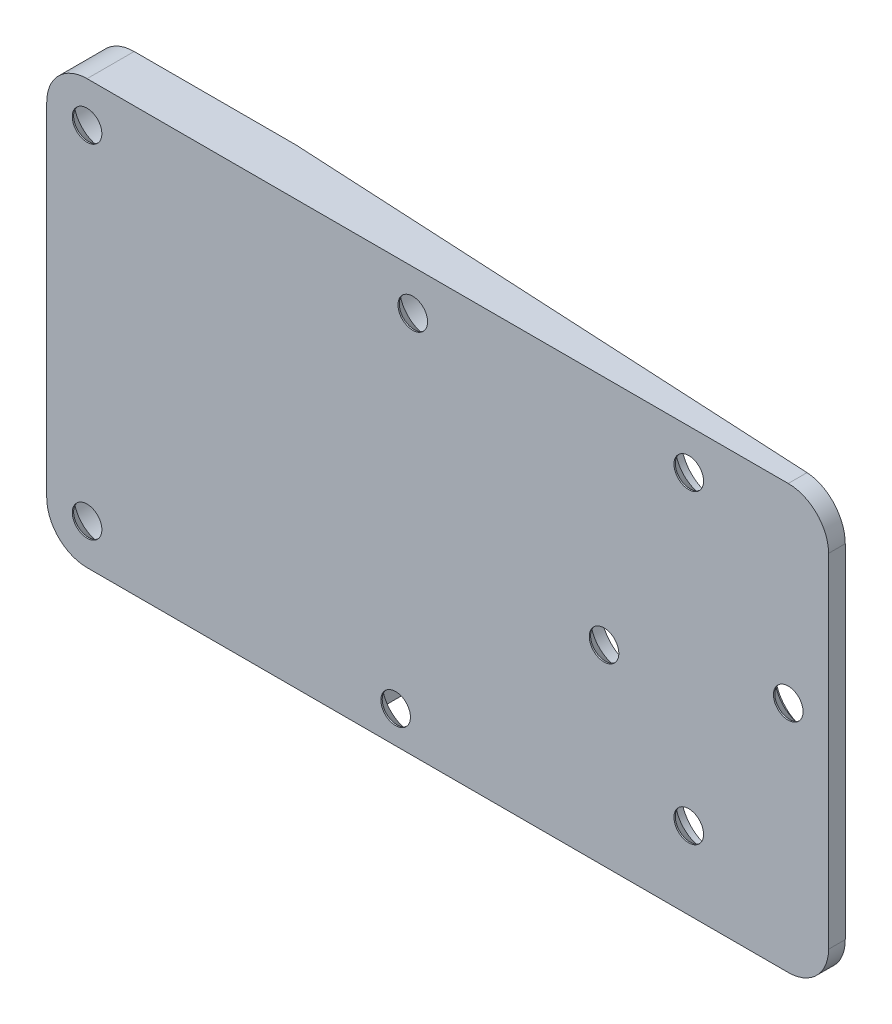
ISO-10303-21;
HEADER;
FILE_DESCRIPTION(('STEP AP214'),'2;1');
FILE_NAME('part.step','',(''),(''),'','','');
FILE_SCHEMA(('AUTOMOTIVE_DESIGN { 1 0 10303 214 1 1 1 1 }'));
ENDSEC;
DATA;
#1=APPLICATION_CONTEXT('core data for automotive mechanical design processes');
#2=APPLICATION_PROTOCOL_DEFINITION('international standard','automotive_design',2000,#1);
#3=PRODUCT_CONTEXT('',#1,'mechanical');
#4=PRODUCT('Part','Part','',(#3));
#5=PRODUCT_RELATED_PRODUCT_CATEGORY('part','',(#4));
#6=PRODUCT_DEFINITION_FORMATION('','',#4);
#7=PRODUCT_DEFINITION_CONTEXT('part definition',#1,'design');
#8=PRODUCT_DEFINITION('design','',#6,#7);
#9=PRODUCT_DEFINITION_SHAPE('','',#8);
#10=(LENGTH_UNIT() NAMED_UNIT(*) SI_UNIT(.MILLI.,.METRE.));
#11=(NAMED_UNIT(*) PLANE_ANGLE_UNIT() SI_UNIT($,.RADIAN.));
#12=(NAMED_UNIT(*) SI_UNIT($,.STERADIAN.) SOLID_ANGLE_UNIT());
#13=UNCERTAINTY_MEASURE_WITH_UNIT(LENGTH_MEASURE(1.E-05),#10,'distance_accuracy_value','');
#14=(GEOMETRIC_REPRESENTATION_CONTEXT(3) GLOBAL_UNCERTAINTY_ASSIGNED_CONTEXT((#13)) GLOBAL_UNIT_ASSIGNED_CONTEXT((#10,
#11,#12)) REPRESENTATION_CONTEXT('',''));
#15=CARTESIAN_POINT('',(0.,0.,0.));
#16=DIRECTION('',(0.,0.,1.));
#17=DIRECTION('',(1.,0.,0.));
#18=AXIS2_PLACEMENT_3D('',#15,#16,#17);
#19=CARTESIAN_POINT('',(19.5809830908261,-59.7,-6.));
#20=DIRECTION('',(0.0523359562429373,0.,-0.998629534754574));
#21=DIRECTION('',(-0.998629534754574,0.,-0.0523359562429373));
#22=AXIS2_PLACEMENT_3D('',#19,#20,#21);
#23=PLANE('',#22);
#24=CARTESIAN_POINT('',(31.7740209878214,-64.25,-5.36098996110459));
#25=DIRECTION('',(0.0523359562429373,0.,-0.998629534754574));
#26=DIRECTION('',(-0.998629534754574,0.,-0.0523359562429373));
#27=AXIS2_PLACEMENT_3D('',#24,#25,#26);
#28=ELLIPSE('',#27,2.5034308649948,2.5);
#29=CARTESIAN_POINT('',(29.2740209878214,-64.25,-5.49200940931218));
#30=VERTEX_POINT('',#29);
#31=EDGE_CURVE('E227',#30,#30,#28,.T.);
#32=ORIENTED_EDGE('',*,*,#31,.F.);
#33=EDGE_LOOP('',(#32));
#34=FACE_BOUND('',#33,.T.);
#35=CARTESIAN_POINT('',(52.3,-64.25,-4.28526898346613));
#36=DIRECTION('',(0.0523359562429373,0.,-0.998629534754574));
#37=DIRECTION('',(-0.998629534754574,0.,-0.0523359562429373));
#38=AXIS2_PLACEMENT_3D('',#35,#36,#37);
#39=ELLIPSE('',#38,2.5034308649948,2.5);
#40=CARTESIAN_POINT('',(49.8,-64.25,-4.41628843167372));
#41=VERTEX_POINT('',#40);
#42=EDGE_CURVE('E244',#41,#41,#39,.T.);
#43=ORIENTED_EDGE('',*,*,#42,.F.);
#44=EDGE_LOOP('',(#43));
#45=FACE_BOUND('',#44,.T.);
#46=CARTESIAN_POINT('',(46.,-78.5,-4.61543799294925));
#47=DIRECTION('',(0.0523359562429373,0.,-0.998629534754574));
#48=DIRECTION('',(-0.998629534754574,0.,-0.0523359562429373));
#49=AXIS2_PLACEMENT_3D('',#46,#47,#48);
#50=ELLIPSE('',#49,2.5034308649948,2.5);
#51=CARTESIAN_POINT('',(43.5,-78.5,-4.74645744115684));
#52=VERTEX_POINT('',#51);
#53=EDGE_CURVE('E261',#52,#52,#50,.T.);
#54=ORIENTED_EDGE('',*,*,#53,.F.);
#55=EDGE_LOOP('',(#54));
#56=FACE_BOUND('',#55,.T.);
#57=CARTESIAN_POINT('',(52.3,-87.,-4.28526898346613));
#58=DIRECTION('',(0.0523359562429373,0.,-0.998629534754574));
#59=DIRECTION('',(-0.998629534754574,0.,-0.0523359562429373));
#60=AXIS2_PLACEMENT_3D('',#57,#58,#59);
#61=ELLIPSE('',#60,2.5034308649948,2.5);
#62=CARTESIAN_POINT('',(49.8,-87.,-4.41628843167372));
#63=VERTEX_POINT('',#62);
#64=EDGE_CURVE('E278',#63,#63,#61,.T.);
#65=ORIENTED_EDGE('',*,*,#64,.F.);
#66=EDGE_LOOP('',(#65));
#67=FACE_BOUND('',#66,.T.);
#68=CARTESIAN_POINT('',(59.7,-75.4,-3.89745141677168));
#69=DIRECTION('',(0.0523359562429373,0.,-0.998629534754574));
#70=DIRECTION('',(-0.998629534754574,0.,-0.0523359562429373));
#71=AXIS2_PLACEMENT_3D('',#68,#69,#70);
#72=ELLIPSE('',#71,2.5034308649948,2.5);
#73=CARTESIAN_POINT('',(57.2,-75.4,-4.02847086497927));
#74=VERTEX_POINT('',#73);
#75=EDGE_CURVE('E295',#74,#74,#72,.T.);
#76=ORIENTED_EDGE('',*,*,#75,.F.);
#77=EDGE_LOOP('',(#76));
#78=FACE_BOUND('',#77,.T.);
#79=DIRECTION('',(0.,-1.,0.));
#80=VECTOR('',#79,1.);
#81=CARTESIAN_POINT('',(28.,-59.7,-5.55877802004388));
#82=LINE('',#81,#80);
#83=CARTESIAN_POINT('',(28.,-90.35,-5.55877802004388));
#84=VERTEX_POINT('',#83);
#85=CARTESIAN_POINT('',(28.,-92.25,-5.55877802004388));
#86=VERTEX_POINT('',#85);
#87=EDGE_CURVE('E441',#84,#86,#82,.T.);
#88=ORIENTED_EDGE('',*,*,#87,.T.);
#89=DIRECTION('',(0.706621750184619,0.706621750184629,0.0370324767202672));
#90=VECTOR('',#89,1.);
#91=CARTESIAN_POINT('',(40.0373990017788,-80.212600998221,-4.92792467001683));
#92=LINE('',#91,#90);
#93=CARTESIAN_POINT('',(27.5,-92.75,-5.58498190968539));
#94=VERTEX_POINT('',#93);
#95=EDGE_CURVE('E428',#86,#94,#92,.F.);
#96=ORIENTED_EDGE('',*,*,#95,.T.);
#97=DIRECTION('',(0.998629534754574,0.,0.0523359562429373));
#98=VECTOR('',#97,1.);
#99=CARTESIAN_POINT('',(7.54178284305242,-92.75,-6.63094774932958));
#100=LINE('',#99,#98);
#101=CARTESIAN_POINT('',(19.5809830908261,-92.75,-6.));
#102=VERTEX_POINT('',#101);
#103=EDGE_CURVE('E367',#102,#94,#100,.T.);
#104=ORIENTED_EDGE('',*,*,#103,.F.);
#105=DIRECTION('',(0.,-1.,0.));
#106=VECTOR('',#105,1.);
#107=CARTESIAN_POINT('',(19.5809830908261,-59.7,-6.));
#108=LINE('',#107,#106);
#109=CARTESIAN_POINT('',(19.5809830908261,-61.25,-6.));
#110=VERTEX_POINT('',#109);
#111=EDGE_CURVE('E329',#110,#102,#108,.T.);
#112=ORIENTED_EDGE('',*,*,#111,.F.);
#113=DIRECTION('',(-0.998629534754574,0.,-0.0523359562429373));
#114=VECTOR('',#113,1.);
#115=CARTESIAN_POINT('',(7.54178284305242,-61.25,-6.63094774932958));
#116=LINE('',#115,#114);
#117=CARTESIAN_POINT('',(59.7,-61.25,-3.89745141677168));
#118=VERTEX_POINT('',#117);
#119=EDGE_CURVE('E343',#118,#110,#116,.T.);
#120=ORIENTED_EDGE('',*,*,#119,.F.);
#121=CARTESIAN_POINT('',(59.7,-64.25,-3.89745141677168));
#122=DIRECTION('',(0.0523359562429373,0.,-0.998629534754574));
#123=DIRECTION('',(0.998629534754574,0.,0.0523359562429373));
#124=AXIS2_PLACEMENT_3D('',#121,#122,#123);
#125=ELLIPSE('',#124,3.00411703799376,3.);
#126=CARTESIAN_POINT('',(62.7,-64.25,-3.74022807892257));
#127=VERTEX_POINT('',#126);
#128=EDGE_CURVE('E352',#127,#118,#125,.F.);
#129=ORIENTED_EDGE('',*,*,#128,.F.);
#130=DIRECTION('',(0.,1.,0.));
#131=VECTOR('',#130,1.);
#132=CARTESIAN_POINT('',(62.7,-89.75,-3.74022807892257));
#133=LINE('',#132,#131);
#134=CARTESIAN_POINT('',(62.7,-89.75,-3.74022807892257));
#135=VERTEX_POINT('',#134);
#136=EDGE_CURVE('E357',#135,#127,#133,.T.);
#137=ORIENTED_EDGE('',*,*,#136,.F.);
#138=CARTESIAN_POINT('',(59.7,-89.75,-3.89745141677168));
#139=DIRECTION('',(0.0523359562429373,0.,-0.998629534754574));
#140=DIRECTION('',(0.998629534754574,0.,0.0523359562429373));
#141=AXIS2_PLACEMENT_3D('',#138,#139,#140);
#142=ELLIPSE('',#141,3.00411703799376,3.);
#143=CARTESIAN_POINT('',(59.7,-92.75,-3.89745141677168));
#144=VERTEX_POINT('',#143);
#145=EDGE_CURVE('E362',#144,#135,#142,.F.);
#146=ORIENTED_EDGE('',*,*,#145,.F.);
#147=CARTESIAN_POINT('',(33.5,-92.75,-5.27053523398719));
#148=VERTEX_POINT('',#147);
#149=EDGE_CURVE('E371',#148,#144,#100,.T.);
#150=ORIENTED_EDGE('',*,*,#149,.F.);
#151=DIRECTION('',(0.706621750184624,-0.706621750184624,0.0370324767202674));
#152=VECTOR('',#151,1.);
#153=CARTESIAN_POINT('',(10.0286097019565,-69.2786097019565,-6.50061867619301));
#154=LINE('',#153,#152);
#155=CARTESIAN_POINT('',(33.,-92.25,-5.2967391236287));
#156=VERTEX_POINT('',#155);
#157=EDGE_CURVE('E75',#148,#156,#154,.F.);
#158=ORIENTED_EDGE('',*,*,#157,.T.);
#159=DIRECTION('',(0.,1.,0.));
#160=VECTOR('',#159,1.);
#161=CARTESIAN_POINT('',(33.,-59.7,-5.2967391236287));
#162=LINE('',#161,#160);
#163=CARTESIAN_POINT('',(33.,-90.35,-5.2967391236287));
#164=VERTEX_POINT('',#163);
#165=EDGE_CURVE('E927',#156,#164,#162,.T.);
#166=ORIENTED_EDGE('',*,*,#165,.T.);
#167=CARTESIAN_POINT('',(30.5,-90.35,-5.42775857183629));
#168=DIRECTION('',(0.0523359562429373,0.,-0.998629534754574));
#169=DIRECTION('',(-0.998629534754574,0.,-0.0523359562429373));
#170=AXIS2_PLACEMENT_3D('',#167,#168,#169);
#171=ELLIPSE('',#170,2.5034308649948,2.5);
#172=EDGE_CURVE('E179',#84,#164,#171,.T.);
#173=ORIENTED_EDGE('',*,*,#172,.F.);
#174=EDGE_LOOP('',(#88,#96,#104,#112,#120,#129,#137,#146,#150,#158,#166,#173));
#175=FACE_BOUND('',#174,.T.);
#176=ADVANCED_FACE('F53',(#34,#45,#56,#67,#78,#175),#23,.T.);
#177=CARTESIAN_POINT('',(7.55000000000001,-92.75,-6.78774044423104));
#178=DIRECTION('',(0.,-1.,0.));
#179=DIRECTION('',(0.,0.,-1.));
#180=AXIS2_PLACEMENT_3D('',#177,#178,#179);
#181=PLANE('',#180);
#182=ORIENTED_EDGE('',*,*,#103,.T.);
#183=DIRECTION('',(0.,0.,1.));
#184=VECTOR('',#183,1.);
#185=CARTESIAN_POINT('',(27.5,-92.75,-6.78774044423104));
#186=LINE('',#185,#184);
#187=CARTESIAN_POINT('',(27.5,-92.75,-3.69999999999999));
#188=VERTEX_POINT('',#187);
#189=EDGE_CURVE('E419',#94,#188,#186,.T.);
#190=ORIENTED_EDGE('',*,*,#189,.T.);
#191=DIRECTION('',(-1.,0.,0.));
#192=VECTOR('',#191,1.);
#193=CARTESIAN_POINT('',(7.55000000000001,-92.75,-3.69999999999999));
#194=LINE('',#193,#192);
#195=CARTESIAN_POINT('',(33.5,-92.75,-3.69999999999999));
#196=VERTEX_POINT('',#195);
#197=EDGE_CURVE('E397',#196,#188,#194,.T.);
#198=ORIENTED_EDGE('',*,*,#197,.F.);
#199=DIRECTION('',(0.,0.,-1.));
#200=VECTOR('',#199,1.);
#201=CARTESIAN_POINT('',(33.5,-92.75,-6.78774044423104));
#202=LINE('',#201,#200);
#203=EDGE_CURVE('E181',#196,#148,#202,.T.);
#204=ORIENTED_EDGE('',*,*,#203,.T.);
#205=ORIENTED_EDGE('',*,*,#149,.T.);
#206=DIRECTION('',(0.,0.,1.));
#207=VECTOR('',#206,1.);
#208=CARTESIAN_POINT('',(59.7,-92.75,-6.78774044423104));
#209=LINE('',#208,#207);
#210=CARTESIAN_POINT('',(59.7,-92.75,-2.5));
#211=VERTEX_POINT('',#210);
#212=EDGE_CURVE('E366',#144,#211,#209,.T.);
#213=ORIENTED_EDGE('',*,*,#212,.T.);
#214=DIRECTION('',(1.,0.,0.));
#215=VECTOR('',#214,1.);
#216=CARTESIAN_POINT('',(7.55000000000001,-92.75,-2.5));
#217=LINE('',#216,#215);
#218=CARTESIAN_POINT('',(7.55000000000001,-92.75,-2.5));
#219=VERTEX_POINT('',#218);
#220=EDGE_CURVE('E313',#219,#211,#217,.T.);
#221=ORIENTED_EDGE('',*,*,#220,.F.);
#222=DIRECTION('',(0.,0.,1.));
#223=VECTOR('',#222,1.);
#224=CARTESIAN_POINT('',(7.55000000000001,-92.75,-6.78774044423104));
#225=LINE('',#224,#223);
#226=CARTESIAN_POINT('',(7.55000000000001,-92.75,-6.00000000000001));
#227=VERTEX_POINT('',#226);
#228=EDGE_CURVE('E376',#227,#219,#225,.T.);
#229=ORIENTED_EDGE('',*,*,#228,.F.);
#230=DIRECTION('',(1.,0.,0.));
#231=VECTOR('',#230,1.);
#232=CARTESIAN_POINT('',(7.55000000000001,-92.75,-6.00000000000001));
#233=LINE('',#232,#231);
#234=EDGE_CURVE('E372',#227,#102,#233,.T.);
#235=ORIENTED_EDGE('',*,*,#234,.T.);
#236=EDGE_LOOP('',(#182,#190,#198,#204,#205,#213,#221,#229,#235));
#237=FACE_BOUND('',#236,.T.);
#238=ADVANCED_FACE('F447',(#237),#181,.T.);
#239=CARTESIAN_POINT('',(30.5,-90.35,-5.99999999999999));
#240=DIRECTION('',(0.,0.,-1.));
#241=DIRECTION('',(-1.,0.,0.));
#242=AXIS2_PLACEMENT_3D('',#239,#240,#241);
#243=CYLINDRICAL_SURFACE('',#242,2.5);
#244=ORIENTED_EDGE('',*,*,#172,.T.);
#245=DIRECTION('',(0.,0.,-1.));
#246=VECTOR('',#245,1.);
#247=CARTESIAN_POINT('',(33.,-90.35,-5.99999999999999));
#248=LINE('',#247,#246);
#249=CARTESIAN_POINT('',(33.,-90.35,-3.69999999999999));
#250=VERTEX_POINT('',#249);
#251=EDGE_CURVE('E165',#164,#250,#248,.F.);
#252=ORIENTED_EDGE('',*,*,#251,.T.);
#253=CARTESIAN_POINT('',(30.5,-90.35,-3.69999999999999));
#254=DIRECTION('',(0.,0.,-1.));
#255=DIRECTION('',(-1.,0.,0.));
#256=AXIS2_PLACEMENT_3D('',#253,#254,#255);
#257=CIRCLE('',#256,2.5);
#258=CARTESIAN_POINT('',(28.,-90.35,-3.69999999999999));
#259=VERTEX_POINT('',#258);
#260=EDGE_CURVE('E177',#259,#250,#257,.T.);
#261=ORIENTED_EDGE('',*,*,#260,.F.);
#262=DIRECTION('',(0.,0.,-1.));
#263=VECTOR('',#262,1.);
#264=CARTESIAN_POINT('',(28.,-90.35,-5.99999999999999));
#265=LINE('',#264,#263);
#266=EDGE_CURVE('E182',#84,#259,#265,.F.);
#267=ORIENTED_EDGE('',*,*,#266,.F.);
#268=EDGE_LOOP('',(#244,#252,#261,#267));
#269=FACE_BOUND('',#268,.T.);
#270=ADVANCED_FACE('F175',(#269),#243,.F.);
#271=CARTESIAN_POINT('',(0.,-59.7,-6.00000000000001));
#272=DIRECTION('',(0.,0.,-1.));
#273=DIRECTION('',(-1.,0.,0.));
#274=AXIS2_PLACEMENT_3D('',#271,#272,#273);
#275=PLANE('',#274);
#276=CARTESIAN_POINT('',(7.55000000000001,-64.25,-6.00000000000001));
#277=DIRECTION('',(0.,0.,-1.));
#278=DIRECTION('',(-1.,0.,0.));
#279=AXIS2_PLACEMENT_3D('',#276,#277,#278);
#280=CIRCLE('',#279,2.5);
#281=CARTESIAN_POINT('',(5.05000000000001,-64.25,-6.00000000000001));
#282=VERTEX_POINT('',#281);
#283=EDGE_CURVE('E501',#282,#282,#280,.T.);
#284=ORIENTED_EDGE('',*,*,#283,.F.);
#285=EDGE_LOOP('',(#284));
#286=FACE_BOUND('',#285,.T.);
#287=CARTESIAN_POINT('',(7.55000000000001,-89.75,-6.00000000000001));
#288=DIRECTION('',(0.,0.,-1.));
#289=DIRECTION('',(-1.,0.,0.));
#290=AXIS2_PLACEMENT_3D('',#287,#288,#289);
#291=CIRCLE('',#290,2.5);
#292=CARTESIAN_POINT('',(5.05000000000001,-89.75,-6.00000000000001));
#293=VERTEX_POINT('',#292);
#294=EDGE_CURVE('E504',#293,#293,#291,.T.);
#295=ORIENTED_EDGE('',*,*,#294,.F.);
#296=EDGE_LOOP('',(#295));
#297=FACE_BOUND('',#296,.T.);
#298=DIRECTION('',(-1.,0.,0.));
#299=VECTOR('',#298,1.);
#300=CARTESIAN_POINT('',(7.55000000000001,-61.25,-6.00000000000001));
#301=LINE('',#300,#299);
#302=CARTESIAN_POINT('',(7.55000000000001,-61.25,-6.00000000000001));
#303=VERTEX_POINT('',#302);
#304=EDGE_CURVE('E347',#110,#303,#301,.T.);
#305=ORIENTED_EDGE('',*,*,#304,.F.);
#306=ORIENTED_EDGE('',*,*,#111,.T.);
#307=ORIENTED_EDGE('',*,*,#234,.F.);
#308=CARTESIAN_POINT('',(7.55000000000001,-89.75,-6.00000000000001));
#309=DIRECTION('',(0.,0.,-1.));
#310=DIRECTION('',(-1.,0.,0.));
#311=AXIS2_PLACEMENT_3D('',#308,#309,#310);
#312=CIRCLE('',#311,3.);
#313=CARTESIAN_POINT('',(4.55,-89.75,-6.00000000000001));
#314=VERTEX_POINT('',#313);
#315=EDGE_CURVE('E377',#314,#227,#312,.F.);
#316=ORIENTED_EDGE('',*,*,#315,.F.);
#317=DIRECTION('',(0.,-1.,0.));
#318=VECTOR('',#317,1.);
#319=CARTESIAN_POINT('',(4.55,-89.75,-6.00000000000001));
#320=LINE('',#319,#318);
#321=CARTESIAN_POINT('',(4.55,-64.25,-6.00000000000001));
#322=VERTEX_POINT('',#321);
#323=EDGE_CURVE('E300',#322,#314,#320,.T.);
#324=ORIENTED_EDGE('',*,*,#323,.F.);
#325=CARTESIAN_POINT('',(7.55000000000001,-64.25,-6.00000000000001));
#326=DIRECTION('',(0.,0.,-1.));
#327=DIRECTION('',(-1.,0.,0.));
#328=AXIS2_PLACEMENT_3D('',#325,#326,#327);
#329=CIRCLE('',#328,3.);
#330=EDGE_CURVE('E337',#303,#322,#329,.F.);
#331=ORIENTED_EDGE('',*,*,#330,.F.);
#332=EDGE_LOOP('',(#305,#306,#307,#316,#324,#331));
#333=FACE_BOUND('',#332,.T.);
#334=ADVANCED_FACE('F451',(#286,#297,#333),#275,.T.);
#335=CARTESIAN_POINT('',(7.55000000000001,-64.25,-2.5));
#336=DIRECTION('',(0.,0.,1.));
#337=DIRECTION('',(1.,0.,0.));
#338=AXIS2_PLACEMENT_3D('',#335,#336,#337);
#339=PLANE('',#338);
#340=CARTESIAN_POINT('',(7.55000000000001,-64.25,-2.5));
#341=DIRECTION('',(0.,0.,-1.));
#342=DIRECTION('',(-1.,0.,0.));
#343=AXIS2_PLACEMENT_3D('',#340,#341,#342);
#344=CIRCLE('',#343,1.1);
#345=CARTESIAN_POINT('',(6.45000000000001,-64.25,-2.5));
#346=VERTEX_POINT('',#345);
#347=EDGE_CURVE('E508',#346,#346,#344,.T.);
#348=ORIENTED_EDGE('',*,*,#347,.T.);
#349=EDGE_LOOP('',(#348));
#350=FACE_BOUND('',#349,.T.);
#351=CARTESIAN_POINT('',(7.55000000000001,-89.75,-2.5));
#352=DIRECTION('',(0.,0.,-1.));
#353=DIRECTION('',(-1.,0.,0.));
#354=AXIS2_PLACEMENT_3D('',#351,#352,#353);
#355=CIRCLE('',#354,1.1);
#356=CARTESIAN_POINT('',(6.45000000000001,-89.75,-2.5));
#357=VERTEX_POINT('',#356);
#358=EDGE_CURVE('E190',#357,#357,#355,.T.);
#359=ORIENTED_EDGE('',*,*,#358,.T.);
#360=EDGE_LOOP('',(#359));
#361=FACE_BOUND('',#360,.T.);
#362=CARTESIAN_POINT('',(30.5,-90.35,-2.49999999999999));
#363=DIRECTION('',(0.,0.,-1.));
#364=DIRECTION('',(-1.,0.,0.));
#365=AXIS2_PLACEMENT_3D('',#362,#363,#364);
#366=CIRCLE('',#365,1.1);
#367=CARTESIAN_POINT('',(29.4,-90.35,-2.49999999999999));
#368=VERTEX_POINT('',#367);
#369=EDGE_CURVE('E205',#368,#368,#366,.T.);
#370=ORIENTED_EDGE('',*,*,#369,.T.);
#371=EDGE_LOOP('',(#370));
#372=FACE_BOUND('',#371,.T.);
#373=CARTESIAN_POINT('',(31.7740209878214,-64.25,-2.49999999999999));
#374=DIRECTION('',(0.,0.,-1.));
#375=DIRECTION('',(-1.,0.,0.));
#376=AXIS2_PLACEMENT_3D('',#373,#374,#375);
#377=CIRCLE('',#376,1.1);
#378=CARTESIAN_POINT('',(30.6740209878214,-64.25,-2.49999999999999));
#379=VERTEX_POINT('',#378);
#380=EDGE_CURVE('E223',#379,#379,#377,.T.);
#381=ORIENTED_EDGE('',*,*,#380,.T.);
#382=EDGE_LOOP('',(#381));
#383=FACE_BOUND('',#382,.T.);
#384=CARTESIAN_POINT('',(52.3,-64.25,-2.49999999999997));
#385=DIRECTION('',(0.,0.,-1.));
#386=DIRECTION('',(-1.,0.,0.));
#387=AXIS2_PLACEMENT_3D('',#384,#385,#386);
#388=CIRCLE('',#387,1.1);
#389=CARTESIAN_POINT('',(51.2,-64.25,-2.49999999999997));
#390=VERTEX_POINT('',#389);
#391=EDGE_CURVE('E240',#390,#390,#388,.T.);
#392=ORIENTED_EDGE('',*,*,#391,.T.);
#393=EDGE_LOOP('',(#392));
#394=FACE_BOUND('',#393,.T.);
#395=CARTESIAN_POINT('',(46.,-78.5,-2.49999999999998));
#396=DIRECTION('',(0.,0.,-1.));
#397=DIRECTION('',(-1.,0.,0.));
#398=AXIS2_PLACEMENT_3D('',#395,#396,#397);
#399=CIRCLE('',#398,1.1);
#400=CARTESIAN_POINT('',(44.9,-78.5,-2.49999999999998));
#401=VERTEX_POINT('',#400);
#402=EDGE_CURVE('E257',#401,#401,#399,.T.);
#403=ORIENTED_EDGE('',*,*,#402,.T.);
#404=EDGE_LOOP('',(#403));
#405=FACE_BOUND('',#404,.T.);
#406=CARTESIAN_POINT('',(52.3,-87.,-2.49999999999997));
#407=DIRECTION('',(0.,0.,-1.));
#408=DIRECTION('',(-1.,0.,0.));
#409=AXIS2_PLACEMENT_3D('',#406,#407,#408);
#410=CIRCLE('',#409,1.1);
#411=CARTESIAN_POINT('',(51.2,-87.,-2.49999999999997));
#412=VERTEX_POINT('',#411);
#413=EDGE_CURVE('E274',#412,#412,#410,.T.);
#414=ORIENTED_EDGE('',*,*,#413,.T.);
#415=EDGE_LOOP('',(#414));
#416=FACE_BOUND('',#415,.T.);
#417=CARTESIAN_POINT('',(59.7,-75.4,-2.49999999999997));
#418=DIRECTION('',(0.,0.,-1.));
#419=DIRECTION('',(-1.,0.,0.));
#420=AXIS2_PLACEMENT_3D('',#417,#418,#419);
#421=CIRCLE('',#420,1.1);
#422=CARTESIAN_POINT('',(58.6,-75.4,-2.49999999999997));
#423=VERTEX_POINT('',#422);
#424=EDGE_CURVE('E291',#423,#423,#421,.T.);
#425=ORIENTED_EDGE('',*,*,#424,.T.);
#426=EDGE_LOOP('',(#425));
#427=FACE_BOUND('',#426,.T.);
#428=CARTESIAN_POINT('',(7.55000000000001,-64.25,-2.5));
#429=DIRECTION('',(0.,0.,1.));
#430=DIRECTION('',(1.,0.,0.));
#431=AXIS2_PLACEMENT_3D('',#428,#429,#430);
#432=CIRCLE('',#431,3.);
#433=CARTESIAN_POINT('',(7.55000000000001,-61.25,-2.5));
#434=VERTEX_POINT('',#433);
#435=CARTESIAN_POINT('',(4.55,-64.25,-2.5));
#436=VERTEX_POINT('',#435);
#437=EDGE_CURVE('E325',#434,#436,#432,.T.);
#438=ORIENTED_EDGE('',*,*,#437,.T.);
#439=DIRECTION('',(0.,-1.,0.));
#440=VECTOR('',#439,1.);
#441=CARTESIAN_POINT('',(4.55,-89.75,-2.5));
#442=LINE('',#441,#440);
#443=CARTESIAN_POINT('',(4.55,-89.75,-2.5));
#444=VERTEX_POINT('',#443);
#445=EDGE_CURVE('E321',#436,#444,#442,.T.);
#446=ORIENTED_EDGE('',*,*,#445,.T.);
#447=CARTESIAN_POINT('',(7.55000000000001,-89.75,-2.5));
#448=DIRECTION('',(0.,0.,1.));
#449=DIRECTION('',(1.,0.,0.));
#450=AXIS2_PLACEMENT_3D('',#447,#448,#449);
#451=CIRCLE('',#450,3.);
#452=EDGE_CURVE('E317',#444,#219,#451,.T.);
#453=ORIENTED_EDGE('',*,*,#452,.T.);
#454=ORIENTED_EDGE('',*,*,#220,.T.);
#455=CARTESIAN_POINT('',(59.7,-89.75,-2.5));
#456=DIRECTION('',(0.,0.,1.));
#457=DIRECTION('',(1.,0.,0.));
#458=AXIS2_PLACEMENT_3D('',#455,#456,#457);
#459=CIRCLE('',#458,3.);
#460=CARTESIAN_POINT('',(62.7,-89.75,-2.5));
#461=VERTEX_POINT('',#460);
#462=EDGE_CURVE('E309',#211,#461,#459,.T.);
#463=ORIENTED_EDGE('',*,*,#462,.T.);
#464=DIRECTION('',(0.,1.,0.));
#465=VECTOR('',#464,1.);
#466=CARTESIAN_POINT('',(62.7,-89.75,-2.5));
#467=LINE('',#466,#465);
#468=CARTESIAN_POINT('',(62.7,-64.25,-2.5));
#469=VERTEX_POINT('',#468);
#470=EDGE_CURVE('E305',#461,#469,#467,.T.);
#471=ORIENTED_EDGE('',*,*,#470,.T.);
#472=CARTESIAN_POINT('',(59.7,-64.25,-2.5));
#473=DIRECTION('',(0.,0.,1.));
#474=DIRECTION('',(1.,0.,0.));
#475=AXIS2_PLACEMENT_3D('',#472,#473,#474);
#476=CIRCLE('',#475,3.);
#477=CARTESIAN_POINT('',(59.7,-61.25,-2.5));
#478=VERTEX_POINT('',#477);
#479=EDGE_CURVE('E301',#469,#478,#476,.T.);
#480=ORIENTED_EDGE('',*,*,#479,.T.);
#481=DIRECTION('',(-1.,0.,0.));
#482=VECTOR('',#481,1.);
#483=CARTESIAN_POINT('',(7.55000000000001,-61.25,-2.5));
#484=LINE('',#483,#482);
#485=EDGE_CURVE('E296',#478,#434,#484,.T.);
#486=ORIENTED_EDGE('',*,*,#485,.T.);
#487=EDGE_LOOP('',(#438,#446,#453,#454,#463,#471,#480,#486));
#488=FACE_BOUND('',#487,.T.);
#489=ADVANCED_FACE('F489',(#350,#361,#372,#383,#394,#405,#416,#427,#488),#339,.T.);
#490=CARTESIAN_POINT('',(4.55,-89.75,-6.78774044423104));
#491=DIRECTION('',(-1.,0.,0.));
#492=DIRECTION('',(0.,0.,1.));
#493=AXIS2_PLACEMENT_3D('',#490,#491,#492);
#494=PLANE('',#493);
#495=DIRECTION('',(0.,0.,1.));
#496=VECTOR('',#495,1.);
#497=CARTESIAN_POINT('',(4.55,-64.25,-6.78774044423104));
#498=LINE('',#497,#496);
#499=EDGE_CURVE('E341',#322,#436,#498,.T.);
#500=ORIENTED_EDGE('',*,*,#499,.F.);
#501=ORIENTED_EDGE('',*,*,#323,.T.);
#502=DIRECTION('',(0.,0.,1.));
#503=VECTOR('',#502,1.);
#504=CARTESIAN_POINT('',(4.55,-89.75,-6.78774044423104));
#505=LINE('',#504,#503);
#506=EDGE_CURVE('E336',#314,#444,#505,.T.);
#507=ORIENTED_EDGE('',*,*,#506,.T.);
#508=ORIENTED_EDGE('',*,*,#445,.F.);
#509=EDGE_LOOP('',(#500,#501,#507,#508));
#510=FACE_BOUND('',#509,.T.);
#511=ADVANCED_FACE('F486',(#510),#494,.T.);
#512=CARTESIAN_POINT('',(7.55000000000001,-89.75,-6.78774044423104));
#513=DIRECTION('',(0.,0.,1.));
#514=DIRECTION('',(1.,0.,0.));
#515=AXIS2_PLACEMENT_3D('',#512,#513,#514);
#516=CYLINDRICAL_SURFACE('',#515,3.);
#517=ORIENTED_EDGE('',*,*,#506,.F.);
#518=ORIENTED_EDGE('',*,*,#315,.T.);
#519=ORIENTED_EDGE('',*,*,#228,.T.);
#520=ORIENTED_EDGE('',*,*,#452,.F.);
#521=EDGE_LOOP('',(#517,#518,#519,#520));
#522=FACE_BOUND('',#521,.T.);
#523=ADVANCED_FACE('F656',(#522),#516,.T.);
#524=CARTESIAN_POINT('',(59.7,-89.75,-6.78774044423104));
#525=DIRECTION('',(0.,0.,1.));
#526=DIRECTION('',(1.,0.,0.));
#527=AXIS2_PLACEMENT_3D('',#524,#525,#526);
#528=CYLINDRICAL_SURFACE('',#527,3.);
#529=ORIENTED_EDGE('',*,*,#212,.F.);
#530=ORIENTED_EDGE('',*,*,#145,.T.);
#531=DIRECTION('',(0.,0.,1.));
#532=VECTOR('',#531,1.);
#533=CARTESIAN_POINT('',(62.7,-89.75,-6.78774044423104));
#534=LINE('',#533,#532);
#535=EDGE_CURVE('E361',#135,#461,#534,.T.);
#536=ORIENTED_EDGE('',*,*,#535,.T.);
#537=ORIENTED_EDGE('',*,*,#462,.F.);
#538=EDGE_LOOP('',(#529,#530,#536,#537));
#539=FACE_BOUND('',#538,.T.);
#540=ADVANCED_FACE('F469',(#539),#528,.T.);
#541=CARTESIAN_POINT('',(62.7,-89.75,-6.78774044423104));
#542=DIRECTION('',(1.,0.,0.));
#543=DIRECTION('',(0.,0.,-1.));
#544=AXIS2_PLACEMENT_3D('',#541,#542,#543);
#545=PLANE('',#544);
#546=ORIENTED_EDGE('',*,*,#535,.F.);
#547=ORIENTED_EDGE('',*,*,#136,.T.);
#548=DIRECTION('',(0.,0.,1.));
#549=VECTOR('',#548,1.);
#550=CARTESIAN_POINT('',(62.7,-64.25,-6.78774044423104));
#551=LINE('',#550,#549);
#552=EDGE_CURVE('E356',#127,#469,#551,.T.);
#553=ORIENTED_EDGE('',*,*,#552,.T.);
#554=ORIENTED_EDGE('',*,*,#470,.F.);
#555=EDGE_LOOP('',(#546,#547,#553,#554));
#556=FACE_BOUND('',#555,.T.);
#557=ADVANCED_FACE('F466',(#556),#545,.T.);
#558=CARTESIAN_POINT('',(59.7,-64.25,-6.78774044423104));
#559=DIRECTION('',(0.,0.,1.));
#560=DIRECTION('',(1.,0.,0.));
#561=AXIS2_PLACEMENT_3D('',#558,#559,#560);
#562=CYLINDRICAL_SURFACE('',#561,3.);
#563=ORIENTED_EDGE('',*,*,#552,.F.);
#564=ORIENTED_EDGE('',*,*,#128,.T.);
#565=DIRECTION('',(0.,0.,1.));
#566=VECTOR('',#565,1.);
#567=CARTESIAN_POINT('',(59.7,-61.25,-6.78774044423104));
#568=LINE('',#567,#566);
#569=EDGE_CURVE('E348',#118,#478,#568,.T.);
#570=ORIENTED_EDGE('',*,*,#569,.T.);
#571=ORIENTED_EDGE('',*,*,#479,.F.);
#572=EDGE_LOOP('',(#563,#564,#570,#571));
#573=FACE_BOUND('',#572,.T.);
#574=ADVANCED_FACE('F460',(#573),#562,.T.);
#575=CARTESIAN_POINT('',(7.55000000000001,-61.25,-6.78774044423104));
#576=DIRECTION('',(0.,1.,0.));
#577=DIRECTION('',(0.,0.,1.));
#578=AXIS2_PLACEMENT_3D('',#575,#576,#577);
#579=PLANE('',#578);
#580=ORIENTED_EDGE('',*,*,#569,.F.);
#581=ORIENTED_EDGE('',*,*,#119,.T.);
#582=ORIENTED_EDGE('',*,*,#304,.T.);
#583=DIRECTION('',(0.,0.,1.));
#584=VECTOR('',#583,1.);
#585=CARTESIAN_POINT('',(7.55000000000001,-61.25,-6.78774044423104));
#586=LINE('',#585,#584);
#587=EDGE_CURVE('E342',#303,#434,#586,.T.);
#588=ORIENTED_EDGE('',*,*,#587,.T.);
#589=ORIENTED_EDGE('',*,*,#485,.F.);
#590=EDGE_LOOP('',(#580,#581,#582,#588,#589));
#591=FACE_BOUND('',#590,.T.);
#592=ADVANCED_FACE('F455',(#591),#579,.T.);
#593=CARTESIAN_POINT('',(7.55000000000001,-64.25,-6.78774044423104));
#594=DIRECTION('',(0.,0.,1.));
#595=DIRECTION('',(1.,0.,0.));
#596=AXIS2_PLACEMENT_3D('',#593,#594,#595);
#597=CYLINDRICAL_SURFACE('',#596,3.);
#598=ORIENTED_EDGE('',*,*,#587,.F.);
#599=ORIENTED_EDGE('',*,*,#330,.T.);
#600=ORIENTED_EDGE('',*,*,#499,.T.);
#601=ORIENTED_EDGE('',*,*,#437,.F.);
#602=EDGE_LOOP('',(#598,#599,#600,#601));
#603=FACE_BOUND('',#602,.T.);
#604=ADVANCED_FACE('F643',(#603),#597,.T.);
#605=CARTESIAN_POINT('',(59.7,-75.4,-5.99999999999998));
#606=DIRECTION('',(0.,0.,-1.));
#607=DIRECTION('',(-1.,0.,0.));
#608=AXIS2_PLACEMENT_3D('',#605,#606,#607);
#609=CYLINDRICAL_SURFACE('',#608,1.1);
#610=ORIENTED_EDGE('',*,*,#424,.F.);
#611=EDGE_LOOP('',(#610));
#612=FACE_BOUND('',#611,.T.);
#613=CARTESIAN_POINT('',(59.7,-75.4,-2.59999999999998));
#614=DIRECTION('',(0.,0.,-1.));
#615=DIRECTION('',(-1.,0.,0.));
#616=AXIS2_PLACEMENT_3D('',#613,#614,#615);
#617=CIRCLE('',#616,1.1);
#618=CARTESIAN_POINT('',(58.6,-75.4,-2.59999999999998));
#619=VERTEX_POINT('',#618);
#620=EDGE_CURVE('E287',#619,#619,#617,.T.);
#621=ORIENTED_EDGE('',*,*,#620,.T.);
#622=EDGE_LOOP('',(#621));
#623=FACE_BOUND('',#622,.T.);
#624=ADVANCED_FACE('F640',(#612,#623),#609,.F.);
#625=CARTESIAN_POINT('',(59.7,-75.4,-3.69999999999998));
#626=DIRECTION('',(0.,0.,-1.));
#627=DIRECTION('',(-1.,0.,0.));
#628=AXIS2_PLACEMENT_3D('',#625,#626,#627);
#629=CONICAL_SURFACE('',#628,2.2,0.78539816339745);
#630=ORIENTED_EDGE('',*,*,#620,.F.);
#631=EDGE_LOOP('',(#630));
#632=FACE_BOUND('',#631,.T.);
#633=CARTESIAN_POINT('',(59.7,-75.4,-3.69999999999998));
#634=DIRECTION('',(0.,0.,-1.));
#635=DIRECTION('',(-1.,0.,0.));
#636=AXIS2_PLACEMENT_3D('',#633,#634,#635);
#637=CIRCLE('',#636,2.2);
#638=CARTESIAN_POINT('',(57.5,-75.4,-3.69999999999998));
#639=VERTEX_POINT('',#638);
#640=EDGE_CURVE('E283',#639,#639,#637,.T.);
#641=ORIENTED_EDGE('',*,*,#640,.T.);
#642=EDGE_LOOP('',(#641));
#643=FACE_BOUND('',#642,.T.);
#644=ADVANCED_FACE('F636',(#632,#643),#629,.F.);
#645=CARTESIAN_POINT('',(61.9,-75.4,-3.69999999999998));
#646=DIRECTION('',(0.,0.,1.));
#647=DIRECTION('',(1.,0.,0.));
#648=AXIS2_PLACEMENT_3D('',#645,#646,#647);
#649=PLANE('',#648);
#650=ORIENTED_EDGE('',*,*,#640,.F.);
#651=EDGE_LOOP('',(#650));
#652=FACE_BOUND('',#651,.T.);
#653=CARTESIAN_POINT('',(59.7,-75.4,-3.69999999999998));
#654=DIRECTION('',(0.,0.,-1.));
#655=DIRECTION('',(-1.,0.,0.));
#656=AXIS2_PLACEMENT_3D('',#653,#654,#655);
#657=CIRCLE('',#656,2.5);
#658=CARTESIAN_POINT('',(57.2,-75.4,-3.69999999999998));
#659=VERTEX_POINT('',#658);
#660=EDGE_CURVE('E279',#659,#659,#657,.T.);
#661=ORIENTED_EDGE('',*,*,#660,.T.);
#662=EDGE_LOOP('',(#661));
#663=FACE_BOUND('',#662,.T.);
#664=ADVANCED_FACE('F632',(#652,#663),#649,.F.);
#665=CARTESIAN_POINT('',(59.7,-75.4,-5.99999999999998));
#666=DIRECTION('',(0.,0.,-1.));
#667=DIRECTION('',(-1.,0.,0.));
#668=AXIS2_PLACEMENT_3D('',#665,#666,#667);
#669=CYLINDRICAL_SURFACE('',#668,2.5);
#670=ORIENTED_EDGE('',*,*,#75,.T.);
#671=EDGE_LOOP('',(#670));
#672=FACE_BOUND('',#671,.T.);
#673=ORIENTED_EDGE('',*,*,#660,.F.);
#674=EDGE_LOOP('',(#673));
#675=FACE_BOUND('',#674,.T.);
#676=ADVANCED_FACE('F628',(#672,#675),#669,.F.);
#677=CARTESIAN_POINT('',(52.3,-87.,-5.99999999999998));
#678=DIRECTION('',(0.,0.,-1.));
#679=DIRECTION('',(-1.,0.,0.));
#680=AXIS2_PLACEMENT_3D('',#677,#678,#679);
#681=CYLINDRICAL_SURFACE('',#680,1.1);
#682=ORIENTED_EDGE('',*,*,#413,.F.);
#683=EDGE_LOOP('',(#682));
#684=FACE_BOUND('',#683,.T.);
#685=CARTESIAN_POINT('',(52.3,-87.,-2.59999999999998));
#686=DIRECTION('',(0.,0.,-1.));
#687=DIRECTION('',(-1.,0.,0.));
#688=AXIS2_PLACEMENT_3D('',#685,#686,#687);
#689=CIRCLE('',#688,1.1);
#690=CARTESIAN_POINT('',(51.2,-87.,-2.59999999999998));
#691=VERTEX_POINT('',#690);
#692=EDGE_CURVE('E270',#691,#691,#689,.T.);
#693=ORIENTED_EDGE('',*,*,#692,.T.);
#694=EDGE_LOOP('',(#693));
#695=FACE_BOUND('',#694,.T.);
#696=ADVANCED_FACE('F624',(#684,#695),#681,.F.);
#697=CARTESIAN_POINT('',(52.3,-87.,-3.69999999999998));
#698=DIRECTION('',(0.,0.,-1.));
#699=DIRECTION('',(-1.,0.,0.));
#700=AXIS2_PLACEMENT_3D('',#697,#698,#699);
#701=CONICAL_SURFACE('',#700,2.2,0.78539816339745);
#702=ORIENTED_EDGE('',*,*,#692,.F.);
#703=EDGE_LOOP('',(#702));
#704=FACE_BOUND('',#703,.T.);
#705=CARTESIAN_POINT('',(52.3,-87.,-3.69999999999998));
#706=DIRECTION('',(0.,0.,-1.));
#707=DIRECTION('',(-1.,0.,0.));
#708=AXIS2_PLACEMENT_3D('',#705,#706,#707);
#709=CIRCLE('',#708,2.2);
#710=CARTESIAN_POINT('',(50.1,-87.,-3.69999999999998));
#711=VERTEX_POINT('',#710);
#712=EDGE_CURVE('E266',#711,#711,#709,.T.);
#713=ORIENTED_EDGE('',*,*,#712,.T.);
#714=EDGE_LOOP('',(#713));
#715=FACE_BOUND('',#714,.T.);
#716=ADVANCED_FACE('F620',(#704,#715),#701,.F.);
#717=CARTESIAN_POINT('',(54.5,-87.,-3.69999999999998));
#718=DIRECTION('',(0.,0.,1.));
#719=DIRECTION('',(1.,0.,0.));
#720=AXIS2_PLACEMENT_3D('',#717,#718,#719);
#721=PLANE('',#720);
#722=ORIENTED_EDGE('',*,*,#712,.F.);
#723=EDGE_LOOP('',(#722));
#724=FACE_BOUND('',#723,.T.);
#725=CARTESIAN_POINT('',(52.3,-87.,-3.69999999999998));
#726=DIRECTION('',(0.,0.,-1.));
#727=DIRECTION('',(-1.,0.,0.));
#728=AXIS2_PLACEMENT_3D('',#725,#726,#727);
#729=CIRCLE('',#728,2.5);
#730=CARTESIAN_POINT('',(49.8,-87.,-3.69999999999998));
#731=VERTEX_POINT('',#730);
#732=EDGE_CURVE('E262',#731,#731,#729,.T.);
#733=ORIENTED_EDGE('',*,*,#732,.T.);
#734=EDGE_LOOP('',(#733));
#735=FACE_BOUND('',#734,.T.);
#736=ADVANCED_FACE('F616',(#724,#735),#721,.F.);
#737=CARTESIAN_POINT('',(52.3,-87.,-5.99999999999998));
#738=DIRECTION('',(0.,0.,-1.));
#739=DIRECTION('',(-1.,0.,0.));
#740=AXIS2_PLACEMENT_3D('',#737,#738,#739);
#741=CYLINDRICAL_SURFACE('',#740,2.5);
#742=ORIENTED_EDGE('',*,*,#64,.T.);
#743=EDGE_LOOP('',(#742));
#744=FACE_BOUND('',#743,.T.);
#745=ORIENTED_EDGE('',*,*,#732,.F.);
#746=EDGE_LOOP('',(#745));
#747=FACE_BOUND('',#746,.T.);
#748=ADVANCED_FACE('F612',(#744,#747),#741,.F.);
#749=CARTESIAN_POINT('',(46.,-78.5,-5.99999999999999));
#750=DIRECTION('',(0.,0.,-1.));
#751=DIRECTION('',(-1.,0.,0.));
#752=AXIS2_PLACEMENT_3D('',#749,#750,#751);
#753=CYLINDRICAL_SURFACE('',#752,1.1);
#754=ORIENTED_EDGE('',*,*,#402,.F.);
#755=EDGE_LOOP('',(#754));
#756=FACE_BOUND('',#755,.T.);
#757=CARTESIAN_POINT('',(46.,-78.5,-2.59999999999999));
#758=DIRECTION('',(0.,0.,-1.));
#759=DIRECTION('',(-1.,0.,0.));
#760=AXIS2_PLACEMENT_3D('',#757,#758,#759);
#761=CIRCLE('',#760,1.1);
#762=CARTESIAN_POINT('',(44.9,-78.5,-2.59999999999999));
#763=VERTEX_POINT('',#762);
#764=EDGE_CURVE('E253',#763,#763,#761,.T.);
#765=ORIENTED_EDGE('',*,*,#764,.T.);
#766=EDGE_LOOP('',(#765));
#767=FACE_BOUND('',#766,.T.);
#768=ADVANCED_FACE('F608',(#756,#767),#753,.F.);
#769=CARTESIAN_POINT('',(46.,-78.5,-3.69999999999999));
#770=DIRECTION('',(0.,0.,-1.));
#771=DIRECTION('',(-1.,0.,0.));
#772=AXIS2_PLACEMENT_3D('',#769,#770,#771);
#773=CONICAL_SURFACE('',#772,2.2,0.78539816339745);
#774=ORIENTED_EDGE('',*,*,#764,.F.);
#775=EDGE_LOOP('',(#774));
#776=FACE_BOUND('',#775,.T.);
#777=CARTESIAN_POINT('',(46.,-78.5,-3.69999999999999));
#778=DIRECTION('',(0.,0.,-1.));
#779=DIRECTION('',(-1.,0.,0.));
#780=AXIS2_PLACEMENT_3D('',#777,#778,#779);
#781=CIRCLE('',#780,2.2);
#782=CARTESIAN_POINT('',(43.8,-78.5,-3.69999999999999));
#783=VERTEX_POINT('',#782);
#784=EDGE_CURVE('E249',#783,#783,#781,.T.);
#785=ORIENTED_EDGE('',*,*,#784,.T.);
#786=EDGE_LOOP('',(#785));
#787=FACE_BOUND('',#786,.T.);
#788=ADVANCED_FACE('F604',(#776,#787),#773,.F.);
#789=CARTESIAN_POINT('',(48.2,-78.5,-3.69999999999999));
#790=DIRECTION('',(0.,0.,1.));
#791=DIRECTION('',(1.,0.,0.));
#792=AXIS2_PLACEMENT_3D('',#789,#790,#791);
#793=PLANE('',#792);
#794=ORIENTED_EDGE('',*,*,#784,.F.);
#795=EDGE_LOOP('',(#794));
#796=FACE_BOUND('',#795,.T.);
#797=CARTESIAN_POINT('',(46.,-78.5,-3.69999999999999));
#798=DIRECTION('',(0.,0.,-1.));
#799=DIRECTION('',(-1.,0.,0.));
#800=AXIS2_PLACEMENT_3D('',#797,#798,#799);
#801=CIRCLE('',#800,2.5);
#802=CARTESIAN_POINT('',(43.5,-78.5,-3.69999999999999));
#803=VERTEX_POINT('',#802);
#804=EDGE_CURVE('E245',#803,#803,#801,.T.);
#805=ORIENTED_EDGE('',*,*,#804,.T.);
#806=EDGE_LOOP('',(#805));
#807=FACE_BOUND('',#806,.T.);
#808=ADVANCED_FACE('F600',(#796,#807),#793,.F.);
#809=CARTESIAN_POINT('',(46.,-78.5,-5.99999999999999));
#810=DIRECTION('',(0.,0.,-1.));
#811=DIRECTION('',(-1.,0.,0.));
#812=AXIS2_PLACEMENT_3D('',#809,#810,#811);
#813=CYLINDRICAL_SURFACE('',#812,2.5);
#814=ORIENTED_EDGE('',*,*,#53,.T.);
#815=EDGE_LOOP('',(#814));
#816=FACE_BOUND('',#815,.T.);
#817=ORIENTED_EDGE('',*,*,#804,.F.);
#818=EDGE_LOOP('',(#817));
#819=FACE_BOUND('',#818,.T.);
#820=ADVANCED_FACE('F596',(#816,#819),#813,.F.);
#821=CARTESIAN_POINT('',(52.3,-64.25,-5.99999999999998));
#822=DIRECTION('',(0.,0.,-1.));
#823=DIRECTION('',(-1.,0.,0.));
#824=AXIS2_PLACEMENT_3D('',#821,#822,#823);
#825=CYLINDRICAL_SURFACE('',#824,1.1);
#826=ORIENTED_EDGE('',*,*,#391,.F.);
#827=EDGE_LOOP('',(#826));
#828=FACE_BOUND('',#827,.T.);
#829=CARTESIAN_POINT('',(52.3,-64.25,-2.59999999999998));
#830=DIRECTION('',(0.,0.,-1.));
#831=DIRECTION('',(-1.,0.,0.));
#832=AXIS2_PLACEMENT_3D('',#829,#830,#831);
#833=CIRCLE('',#832,1.1);
#834=CARTESIAN_POINT('',(51.2,-64.25,-2.59999999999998));
#835=VERTEX_POINT('',#834);
#836=EDGE_CURVE('E236',#835,#835,#833,.T.);
#837=ORIENTED_EDGE('',*,*,#836,.T.);
#838=EDGE_LOOP('',(#837));
#839=FACE_BOUND('',#838,.T.);
#840=ADVANCED_FACE('F592',(#828,#839),#825,.F.);
#841=CARTESIAN_POINT('',(52.3,-64.25,-3.69999999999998));
#842=DIRECTION('',(0.,0.,-1.));
#843=DIRECTION('',(-1.,0.,0.));
#844=AXIS2_PLACEMENT_3D('',#841,#842,#843);
#845=CONICAL_SURFACE('',#844,2.2,0.78539816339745);
#846=ORIENTED_EDGE('',*,*,#836,.F.);
#847=EDGE_LOOP('',(#846));
#848=FACE_BOUND('',#847,.T.);
#849=CARTESIAN_POINT('',(52.3,-64.25,-3.69999999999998));
#850=DIRECTION('',(0.,0.,-1.));
#851=DIRECTION('',(-1.,0.,0.));
#852=AXIS2_PLACEMENT_3D('',#849,#850,#851);
#853=CIRCLE('',#852,2.2);
#854=CARTESIAN_POINT('',(50.1,-64.25,-3.69999999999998));
#855=VERTEX_POINT('',#854);
#856=EDGE_CURVE('E232',#855,#855,#853,.T.);
#857=ORIENTED_EDGE('',*,*,#856,.T.);
#858=EDGE_LOOP('',(#857));
#859=FACE_BOUND('',#858,.T.);
#860=ADVANCED_FACE('F588',(#848,#859),#845,.F.);
#861=CARTESIAN_POINT('',(54.5,-64.25,-3.69999999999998));
#862=DIRECTION('',(0.,0.,1.));
#863=DIRECTION('',(1.,0.,0.));
#864=AXIS2_PLACEMENT_3D('',#861,#862,#863);
#865=PLANE('',#864);
#866=ORIENTED_EDGE('',*,*,#856,.F.);
#867=EDGE_LOOP('',(#866));
#868=FACE_BOUND('',#867,.T.);
#869=CARTESIAN_POINT('',(52.3,-64.25,-3.69999999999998));
#870=DIRECTION('',(0.,0.,-1.));
#871=DIRECTION('',(-1.,0.,0.));
#872=AXIS2_PLACEMENT_3D('',#869,#870,#871);
#873=CIRCLE('',#872,2.5);
#874=CARTESIAN_POINT('',(49.8,-64.25,-3.69999999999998));
#875=VERTEX_POINT('',#874);
#876=EDGE_CURVE('E228',#875,#875,#873,.T.);
#877=ORIENTED_EDGE('',*,*,#876,.T.);
#878=EDGE_LOOP('',(#877));
#879=FACE_BOUND('',#878,.T.);
#880=ADVANCED_FACE('F584',(#868,#879),#865,.F.);
#881=CARTESIAN_POINT('',(52.3,-64.25,-5.99999999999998));
#882=DIRECTION('',(0.,0.,-1.));
#883=DIRECTION('',(-1.,0.,0.));
#884=AXIS2_PLACEMENT_3D('',#881,#882,#883);
#885=CYLINDRICAL_SURFACE('',#884,2.5);
#886=ORIENTED_EDGE('',*,*,#42,.T.);
#887=EDGE_LOOP('',(#886));
#888=FACE_BOUND('',#887,.T.);
#889=ORIENTED_EDGE('',*,*,#876,.F.);
#890=EDGE_LOOP('',(#889));
#891=FACE_BOUND('',#890,.T.);
#892=ADVANCED_FACE('F580',(#888,#891),#885,.F.);
#893=CARTESIAN_POINT('',(31.7740209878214,-64.25,-5.99999999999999));
#894=DIRECTION('',(0.,0.,-1.));
#895=DIRECTION('',(-1.,0.,0.));
#896=AXIS2_PLACEMENT_3D('',#893,#894,#895);
#897=CYLINDRICAL_SURFACE('',#896,1.1);
#898=ORIENTED_EDGE('',*,*,#380,.F.);
#899=EDGE_LOOP('',(#898));
#900=FACE_BOUND('',#899,.T.);
#901=CARTESIAN_POINT('',(31.7740209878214,-64.25,-2.59999999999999));
#902=DIRECTION('',(0.,0.,-1.));
#903=DIRECTION('',(-1.,0.,0.));
#904=AXIS2_PLACEMENT_3D('',#901,#902,#903);
#905=CIRCLE('',#904,1.1);
#906=CARTESIAN_POINT('',(30.6740209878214,-64.25,-2.59999999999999));
#907=VERTEX_POINT('',#906);
#908=EDGE_CURVE('E219',#907,#907,#905,.T.);
#909=ORIENTED_EDGE('',*,*,#908,.T.);
#910=EDGE_LOOP('',(#909));
#911=FACE_BOUND('',#910,.T.);
#912=ADVANCED_FACE('F576',(#900,#911),#897,.F.);
#913=CARTESIAN_POINT('',(31.7740209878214,-64.25,-3.69999999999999));
#914=DIRECTION('',(0.,0.,-1.));
#915=DIRECTION('',(-1.,0.,0.));
#916=AXIS2_PLACEMENT_3D('',#913,#914,#915);
#917=CONICAL_SURFACE('',#916,2.2,0.78539816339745);
#918=ORIENTED_EDGE('',*,*,#908,.F.);
#919=EDGE_LOOP('',(#918));
#920=FACE_BOUND('',#919,.T.);
#921=CARTESIAN_POINT('',(31.7740209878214,-64.25,-3.69999999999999));
#922=DIRECTION('',(0.,0.,-1.));
#923=DIRECTION('',(-1.,0.,0.));
#924=AXIS2_PLACEMENT_3D('',#921,#922,#923);
#925=CIRCLE('',#924,2.2);
#926=CARTESIAN_POINT('',(29.5740209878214,-64.25,-3.69999999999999));
#927=VERTEX_POINT('',#926);
#928=EDGE_CURVE('E215',#927,#927,#925,.T.);
#929=ORIENTED_EDGE('',*,*,#928,.T.);
#930=EDGE_LOOP('',(#929));
#931=FACE_BOUND('',#930,.T.);
#932=ADVANCED_FACE('F572',(#920,#931),#917,.F.);
#933=CARTESIAN_POINT('',(33.9740209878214,-64.25,-3.69999999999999));
#934=DIRECTION('',(0.,0.,1.));
#935=DIRECTION('',(1.,0.,0.));
#936=AXIS2_PLACEMENT_3D('',#933,#934,#935);
#937=PLANE('',#936);
#938=ORIENTED_EDGE('',*,*,#928,.F.);
#939=EDGE_LOOP('',(#938));
#940=FACE_BOUND('',#939,.T.);
#941=CARTESIAN_POINT('',(31.7740209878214,-64.25,-3.69999999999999));
#942=DIRECTION('',(0.,0.,-1.));
#943=DIRECTION('',(-1.,0.,0.));
#944=AXIS2_PLACEMENT_3D('',#941,#942,#943);
#945=CIRCLE('',#944,2.5);
#946=CARTESIAN_POINT('',(29.2740209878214,-64.25,-3.69999999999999));
#947=VERTEX_POINT('',#946);
#948=EDGE_CURVE('E211',#947,#947,#945,.T.);
#949=ORIENTED_EDGE('',*,*,#948,.T.);
#950=EDGE_LOOP('',(#949));
#951=FACE_BOUND('',#950,.T.);
#952=ADVANCED_FACE('F568',(#940,#951),#937,.F.);
#953=CARTESIAN_POINT('',(31.7740209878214,-64.25,-5.99999999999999));
#954=DIRECTION('',(0.,0.,-1.));
#955=DIRECTION('',(-1.,0.,0.));
#956=AXIS2_PLACEMENT_3D('',#953,#954,#955);
#957=CYLINDRICAL_SURFACE('',#956,2.5);
#958=ORIENTED_EDGE('',*,*,#31,.T.);
#959=EDGE_LOOP('',(#958));
#960=FACE_BOUND('',#959,.T.);
#961=ORIENTED_EDGE('',*,*,#948,.F.);
#962=EDGE_LOOP('',(#961));
#963=FACE_BOUND('',#962,.T.);
#964=ADVANCED_FACE('F564',(#960,#963),#957,.F.);
#965=CARTESIAN_POINT('',(30.5,-90.35,-5.99999999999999));
#966=DIRECTION('',(0.,0.,-1.));
#967=DIRECTION('',(-1.,0.,0.));
#968=AXIS2_PLACEMENT_3D('',#965,#966,#967);
#969=CYLINDRICAL_SURFACE('',#968,1.1);
#970=ORIENTED_EDGE('',*,*,#369,.F.);
#971=EDGE_LOOP('',(#970));
#972=FACE_BOUND('',#971,.T.);
#973=CARTESIAN_POINT('',(30.5,-90.35,-2.59999999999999));
#974=DIRECTION('',(0.,0.,-1.));
#975=DIRECTION('',(-1.,0.,0.));
#976=AXIS2_PLACEMENT_3D('',#973,#974,#975);
#977=CIRCLE('',#976,1.1);
#978=CARTESIAN_POINT('',(29.4,-90.35,-2.59999999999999));
#979=VERTEX_POINT('',#978);
#980=EDGE_CURVE('E195',#979,#979,#977,.T.);
#981=ORIENTED_EDGE('',*,*,#980,.T.);
#982=EDGE_LOOP('',(#981));
#983=FACE_BOUND('',#982,.T.);
#984=ADVANCED_FACE('F560',(#972,#983),#969,.F.);
#985=CARTESIAN_POINT('',(30.5,-90.35,-3.69999999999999));
#986=DIRECTION('',(0.,0.,-1.));
#987=DIRECTION('',(-1.,0.,0.));
#988=AXIS2_PLACEMENT_3D('',#985,#986,#987);
#989=CONICAL_SURFACE('',#988,2.2,0.785398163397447);
#990=ORIENTED_EDGE('',*,*,#980,.F.);
#991=EDGE_LOOP('',(#990));
#992=FACE_BOUND('',#991,.T.);
#993=CARTESIAN_POINT('',(30.5,-90.35,-3.69999999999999));
#994=DIRECTION('',(0.,0.,-1.));
#995=DIRECTION('',(-1.,0.,0.));
#996=AXIS2_PLACEMENT_3D('',#993,#994,#995);
#997=CIRCLE('',#996,2.2);
#998=CARTESIAN_POINT('',(28.3,-90.35,-3.69999999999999));
#999=VERTEX_POINT('',#998);
#1000=EDGE_CURVE('E189',#999,#999,#997,.T.);
#1001=ORIENTED_EDGE('',*,*,#1000,.T.);
#1002=EDGE_LOOP('',(#1001));
#1003=FACE_BOUND('',#1002,.T.);
#1004=ADVANCED_FACE('F557',(#992,#1003),#989,.F.);
#1005=CARTESIAN_POINT('',(32.7,-90.35,-3.69999999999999));
#1006=DIRECTION('',(0.,0.,1.));
#1007=DIRECTION('',(1.,0.,0.));
#1008=AXIS2_PLACEMENT_3D('',#1005,#1006,#1007);
#1009=PLANE('',#1008);
#1010=ORIENTED_EDGE('',*,*,#197,.T.);
#1011=DIRECTION('',(-0.707106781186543,-0.707106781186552,0.));
#1012=VECTOR('',#1011,1.);
#1013=CARTESIAN_POINT('',(31.3,-88.95,-3.69999999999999));
#1014=LINE('',#1013,#1012);
#1015=CARTESIAN_POINT('',(28.,-92.25,-3.69999999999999));
#1016=VERTEX_POINT('',#1015);
#1017=EDGE_CURVE('E62',#188,#1016,#1014,.F.);
#1018=ORIENTED_EDGE('',*,*,#1017,.T.);
#1019=DIRECTION('',(0.,1.,0.));
#1020=VECTOR('',#1019,1.);
#1021=CARTESIAN_POINT('',(28.,-92.75,-3.69999999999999));
#1022=LINE('',#1021,#1020);
#1023=EDGE_CURVE('E171',#1016,#259,#1022,.T.);
#1024=ORIENTED_EDGE('',*,*,#1023,.T.);
#1025=ORIENTED_EDGE('',*,*,#260,.T.);
#1026=DIRECTION('',(0.,-1.,0.));
#1027=VECTOR('',#1026,1.);
#1028=CARTESIAN_POINT('',(33.,-90.35,-3.69999999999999));
#1029=LINE('',#1028,#1027);
#1030=CARTESIAN_POINT('',(33.,-92.25,-3.69999999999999));
#1031=VERTEX_POINT('',#1030);
#1032=EDGE_CURVE('E162',#250,#1031,#1029,.T.);
#1033=ORIENTED_EDGE('',*,*,#1032,.T.);
#1034=DIRECTION('',(-0.707106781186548,0.707106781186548,0.));
#1035=VECTOR('',#1034,1.);
#1036=CARTESIAN_POINT('',(31.9,-91.15,-3.69999999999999));
#1037=LINE('',#1036,#1035);
#1038=EDGE_CURVE('E12',#1031,#196,#1037,.F.);
#1039=ORIENTED_EDGE('',*,*,#1038,.T.);
#1040=EDGE_LOOP('',(#1010,#1018,#1024,#1025,#1033,#1039));
#1041=FACE_BOUND('',#1040,.T.);
#1042=ORIENTED_EDGE('',*,*,#1000,.F.);
#1043=EDGE_LOOP('',(#1042));
#1044=FACE_BOUND('',#1043,.T.);
#1045=ADVANCED_FACE('F184',(#1041,#1044),#1009,.F.);
#1046=CARTESIAN_POINT('',(7.55000000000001,-89.75,-6.00000000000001));
#1047=DIRECTION('',(0.,0.,-1.));
#1048=DIRECTION('',(-1.,0.,0.));
#1049=AXIS2_PLACEMENT_3D('',#1046,#1047,#1048);
#1050=CYLINDRICAL_SURFACE('',#1049,1.1);
#1051=ORIENTED_EDGE('',*,*,#358,.F.);
#1052=EDGE_LOOP('',(#1051));
#1053=FACE_BOUND('',#1052,.T.);
#1054=CARTESIAN_POINT('',(7.55000000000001,-89.75,-2.60000000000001));
#1055=DIRECTION('',(0.,0.,-1.));
#1056=DIRECTION('',(-1.,0.,0.));
#1057=AXIS2_PLACEMENT_3D('',#1054,#1055,#1056);
#1058=CIRCLE('',#1057,1.1);
#1059=CARTESIAN_POINT('',(6.45000000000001,-89.75,-2.60000000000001));
#1060=VERTEX_POINT('',#1059);
#1061=EDGE_CURVE('E198',#1060,#1060,#1058,.T.);
#1062=ORIENTED_EDGE('',*,*,#1061,.T.);
#1063=EDGE_LOOP('',(#1062));
#1064=FACE_BOUND('',#1063,.T.);
#1065=ADVANCED_FACE('F526',(#1053,#1064),#1050,.F.);
#1066=CARTESIAN_POINT('',(7.55000000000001,-89.75,-3.70000000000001));
#1067=DIRECTION('',(0.,0.,-1.));
#1068=DIRECTION('',(-1.,0.,0.));
#1069=AXIS2_PLACEMENT_3D('',#1066,#1067,#1068);
#1070=CONICAL_SURFACE('',#1069,2.2,0.785398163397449);
#1071=ORIENTED_EDGE('',*,*,#1061,.F.);
#1072=EDGE_LOOP('',(#1071));
#1073=FACE_BOUND('',#1072,.T.);
#1074=CARTESIAN_POINT('',(7.55000000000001,-89.75,-3.70000000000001));
#1075=DIRECTION('',(0.,0.,-1.));
#1076=DIRECTION('',(-1.,0.,0.));
#1077=AXIS2_PLACEMENT_3D('',#1074,#1075,#1076);
#1078=CIRCLE('',#1077,2.2);
#1079=CARTESIAN_POINT('',(5.35000000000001,-89.75,-3.70000000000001));
#1080=VERTEX_POINT('',#1079);
#1081=EDGE_CURVE('E513',#1080,#1080,#1078,.T.);
#1082=ORIENTED_EDGE('',*,*,#1081,.T.);
#1083=EDGE_LOOP('',(#1082));
#1084=FACE_BOUND('',#1083,.T.);
#1085=ADVANCED_FACE('F528',(#1073,#1084),#1070,.F.);
#1086=CARTESIAN_POINT('',(9.75000000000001,-89.75,-3.70000000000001));
#1087=DIRECTION('',(0.,0.,1.));
#1088=DIRECTION('',(1.,0.,0.));
#1089=AXIS2_PLACEMENT_3D('',#1086,#1087,#1088);
#1090=PLANE('',#1089);
#1091=ORIENTED_EDGE('',*,*,#1081,.F.);
#1092=EDGE_LOOP('',(#1091));
#1093=FACE_BOUND('',#1092,.T.);
#1094=CARTESIAN_POINT('',(7.55000000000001,-89.75,-3.70000000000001));
#1095=DIRECTION('',(0.,0.,-1.));
#1096=DIRECTION('',(-1.,0.,0.));
#1097=AXIS2_PLACEMENT_3D('',#1094,#1095,#1096);
#1098=CIRCLE('',#1097,2.5);
#1099=CARTESIAN_POINT('',(5.05000000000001,-89.75,-3.70000000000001));
#1100=VERTEX_POINT('',#1099);
#1101=EDGE_CURVE('E507',#1100,#1100,#1098,.T.);
#1102=ORIENTED_EDGE('',*,*,#1101,.T.);
#1103=EDGE_LOOP('',(#1102));
#1104=FACE_BOUND('',#1103,.T.);
#1105=ADVANCED_FACE('F531',(#1093,#1104),#1090,.F.);
#1106=CARTESIAN_POINT('',(7.55000000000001,-89.75,-6.00000000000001));
#1107=DIRECTION('',(0.,0.,-1.));
#1108=DIRECTION('',(-1.,0.,0.));
#1109=AXIS2_PLACEMENT_3D('',#1106,#1107,#1108);
#1110=CYLINDRICAL_SURFACE('',#1109,2.5);
#1111=ORIENTED_EDGE('',*,*,#1101,.F.);
#1112=EDGE_LOOP('',(#1111));
#1113=FACE_BOUND('',#1112,.T.);
#1114=ORIENTED_EDGE('',*,*,#294,.T.);
#1115=EDGE_LOOP('',(#1114));
#1116=FACE_BOUND('',#1115,.T.);
#1117=ADVANCED_FACE('F537',(#1113,#1116),#1110,.F.);
#1118=CARTESIAN_POINT('',(7.55000000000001,-64.25,-6.00000000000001));
#1119=DIRECTION('',(0.,0.,-1.));
#1120=DIRECTION('',(-1.,0.,0.));
#1121=AXIS2_PLACEMENT_3D('',#1118,#1119,#1120);
#1122=CYLINDRICAL_SURFACE('',#1121,1.1);
#1123=ORIENTED_EDGE('',*,*,#347,.F.);
#1124=EDGE_LOOP('',(#1123));
#1125=FACE_BOUND('',#1124,.T.);
#1126=CARTESIAN_POINT('',(7.55000000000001,-64.25,-2.60000000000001));
#1127=DIRECTION('',(0.,0.,-1.));
#1128=DIRECTION('',(-1.,0.,0.));
#1129=AXIS2_PLACEMENT_3D('',#1126,#1127,#1128);
#1130=CIRCLE('',#1129,1.1);
#1131=CARTESIAN_POINT('',(6.45000000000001,-64.25,-2.60000000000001));
#1132=VERTEX_POINT('',#1131);
#1133=EDGE_CURVE('E516',#1132,#1132,#1130,.T.);
#1134=ORIENTED_EDGE('',*,*,#1133,.T.);
#1135=EDGE_LOOP('',(#1134));
#1136=FACE_BOUND('',#1135,.T.);
#1137=ADVANCED_FACE('F542',(#1125,#1136),#1122,.F.);
#1138=CARTESIAN_POINT('',(7.55000000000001,-64.25,-3.70000000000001));
#1139=DIRECTION('',(0.,0.,-1.));
#1140=DIRECTION('',(-1.,0.,0.));
#1141=AXIS2_PLACEMENT_3D('',#1138,#1139,#1140);
#1142=CONICAL_SURFACE('',#1141,2.2,0.785398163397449);
#1143=ORIENTED_EDGE('',*,*,#1133,.F.);
#1144=EDGE_LOOP('',(#1143));
#1145=FACE_BOUND('',#1144,.T.);
#1146=CARTESIAN_POINT('',(7.55000000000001,-64.25,-3.70000000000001));
#1147=DIRECTION('',(0.,0.,-1.));
#1148=DIRECTION('',(-1.,0.,0.));
#1149=AXIS2_PLACEMENT_3D('',#1146,#1147,#1148);
#1150=CIRCLE('',#1149,2.2);
#1151=CARTESIAN_POINT('',(5.35000000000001,-64.25,-3.70000000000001));
#1152=VERTEX_POINT('',#1151);
#1153=EDGE_CURVE('E931',#1152,#1152,#1150,.T.);
#1154=ORIENTED_EDGE('',*,*,#1153,.T.);
#1155=EDGE_LOOP('',(#1154));
#1156=FACE_BOUND('',#1155,.T.);
#1157=ADVANCED_FACE('F547',(#1145,#1156),#1142,.F.);
#1158=CARTESIAN_POINT('',(9.75000000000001,-64.25,-3.70000000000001));
#1159=DIRECTION('',(0.,0.,1.));
#1160=DIRECTION('',(1.,0.,0.));
#1161=AXIS2_PLACEMENT_3D('',#1158,#1159,#1160);
#1162=PLANE('',#1161);
#1163=ORIENTED_EDGE('',*,*,#1153,.F.);
#1164=EDGE_LOOP('',(#1163));
#1165=FACE_BOUND('',#1164,.T.);
#1166=CARTESIAN_POINT('',(7.55000000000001,-64.25,-3.70000000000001));
#1167=DIRECTION('',(0.,0.,-1.));
#1168=DIRECTION('',(-1.,0.,0.));
#1169=AXIS2_PLACEMENT_3D('',#1166,#1167,#1168);
#1170=CIRCLE('',#1169,2.5);
#1171=CARTESIAN_POINT('',(5.05000000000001,-64.25,-3.70000000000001));
#1172=VERTEX_POINT('',#1171);
#1173=EDGE_CURVE('E925',#1172,#1172,#1170,.T.);
#1174=ORIENTED_EDGE('',*,*,#1173,.T.);
#1175=EDGE_LOOP('',(#1174));
#1176=FACE_BOUND('',#1175,.T.);
#1177=ADVANCED_FACE('F849',(#1165,#1176),#1162,.F.);
#1178=CARTESIAN_POINT('',(7.55000000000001,-64.25,-6.00000000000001));
#1179=DIRECTION('',(0.,0.,-1.));
#1180=DIRECTION('',(-1.,0.,0.));
#1181=AXIS2_PLACEMENT_3D('',#1178,#1179,#1180);
#1182=CYLINDRICAL_SURFACE('',#1181,2.5);
#1183=ORIENTED_EDGE('',*,*,#1173,.F.);
#1184=EDGE_LOOP('',(#1183));
#1185=FACE_BOUND('',#1184,.T.);
#1186=ORIENTED_EDGE('',*,*,#283,.T.);
#1187=EDGE_LOOP('',(#1186));
#1188=FACE_BOUND('',#1187,.T.);
#1189=ADVANCED_FACE('F858',(#1185,#1188),#1182,.F.);
#1190=CARTESIAN_POINT('',(33.,-90.35,-6.00000000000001));
#1191=DIRECTION('',(-1.,0.,0.));
#1192=DIRECTION('',(0.,0.,1.));
#1193=AXIS2_PLACEMENT_3D('',#1190,#1191,#1192);
#1194=PLANE('',#1193);
#1195=ORIENTED_EDGE('',*,*,#165,.F.);
#1196=DIRECTION('',(0.,0.,1.));
#1197=VECTOR('',#1196,1.);
#1198=CARTESIAN_POINT('',(33.,-92.25,-6.00000000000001));
#1199=LINE('',#1198,#1197);
#1200=EDGE_CURVE('E167',#156,#1031,#1199,.T.);
#1201=ORIENTED_EDGE('',*,*,#1200,.T.);
#1202=ORIENTED_EDGE('',*,*,#1032,.F.);
#1203=ORIENTED_EDGE('',*,*,#251,.F.);
#1204=EDGE_LOOP('',(#1195,#1201,#1202,#1203));
#1205=FACE_BOUND('',#1204,.T.);
#1206=ADVANCED_FACE('F164',(#1205),#1194,.T.);
#1207=CARTESIAN_POINT('',(28.,-92.75,-6.00000000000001));
#1208=DIRECTION('',(1.,0.,0.));
#1209=DIRECTION('',(0.,0.,-1.));
#1210=AXIS2_PLACEMENT_3D('',#1207,#1208,#1209);
#1211=PLANE('',#1210);
#1212=ORIENTED_EDGE('',*,*,#1023,.F.);
#1213=DIRECTION('',(0.,0.,-1.));
#1214=VECTOR('',#1213,1.);
#1215=CARTESIAN_POINT('',(28.,-92.25,-6.00000000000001));
#1216=LINE('',#1215,#1214);
#1217=EDGE_CURVE('E423',#1016,#86,#1216,.T.);
#1218=ORIENTED_EDGE('',*,*,#1217,.T.);
#1219=ORIENTED_EDGE('',*,*,#87,.F.);
#1220=ORIENTED_EDGE('',*,*,#266,.T.);
#1221=EDGE_LOOP('',(#1212,#1218,#1219,#1220));
#1222=FACE_BOUND('',#1221,.T.);
#1223=ADVANCED_FACE('F438',(#1222),#1211,.T.);
#1224=CARTESIAN_POINT('',(27.5,-92.75,-6.78774044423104));
#1225=DIRECTION('',(-0.707106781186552,0.707106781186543,0.));
#1226=DIRECTION('',(0.,0.,1.));
#1227=AXIS2_PLACEMENT_3D('',#1224,#1225,#1226);
#1228=PLANE('',#1227);
#1229=ORIENTED_EDGE('',*,*,#95,.F.);
#1230=ORIENTED_EDGE('',*,*,#1217,.F.);
#1231=ORIENTED_EDGE('',*,*,#1017,.F.);
#1232=ORIENTED_EDGE('',*,*,#189,.F.);
#1233=EDGE_LOOP('',(#1229,#1230,#1231,#1232));
#1234=FACE_BOUND('',#1233,.T.);
#1235=ADVANCED_FACE('F444',(#1234),#1228,.F.);
#1236=CARTESIAN_POINT('',(33.,-92.25,-6.00000000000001));
#1237=DIRECTION('',(0.707106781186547,0.707106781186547,0.));
#1238=DIRECTION('',(0.,0.,1.));
#1239=AXIS2_PLACEMENT_3D('',#1236,#1237,#1238);
#1240=PLANE('',#1239);
#1241=ORIENTED_EDGE('',*,*,#157,.F.);
#1242=ORIENTED_EDGE('',*,*,#203,.F.);
#1243=ORIENTED_EDGE('',*,*,#1038,.F.);
#1244=ORIENTED_EDGE('',*,*,#1200,.F.);
#1245=EDGE_LOOP('',(#1241,#1242,#1243,#1244));
#1246=FACE_BOUND('',#1245,.T.);
#1247=ADVANCED_FACE('F55',(#1246),#1240,.F.);
#1248=CLOSED_SHELL('',(#176,#238,#270,#334,#489,#511,#523,#540,#557,#574,#592,#604,#624,#644,
#664,#676,#696,#716,#736,#748,#768,#788,#808,#820,#840,#860,#880,#892,#912,#932,#952,#964,#984,
#1004,#1045,#1065,#1085,#1105,#1117,#1137,#1157,#1177,#1189,#1206,#1223,#1235,#1247));
#1249=MANIFOLD_SOLID_BREP('B2',#1248);
#1250=ADVANCED_BREP_SHAPE_REPRESENTATION('',(#18,#1249),#14);
#1251=SHAPE_DEFINITION_REPRESENTATION(#9,#1250);
ENDSEC;
END-ISO-10303-21;
